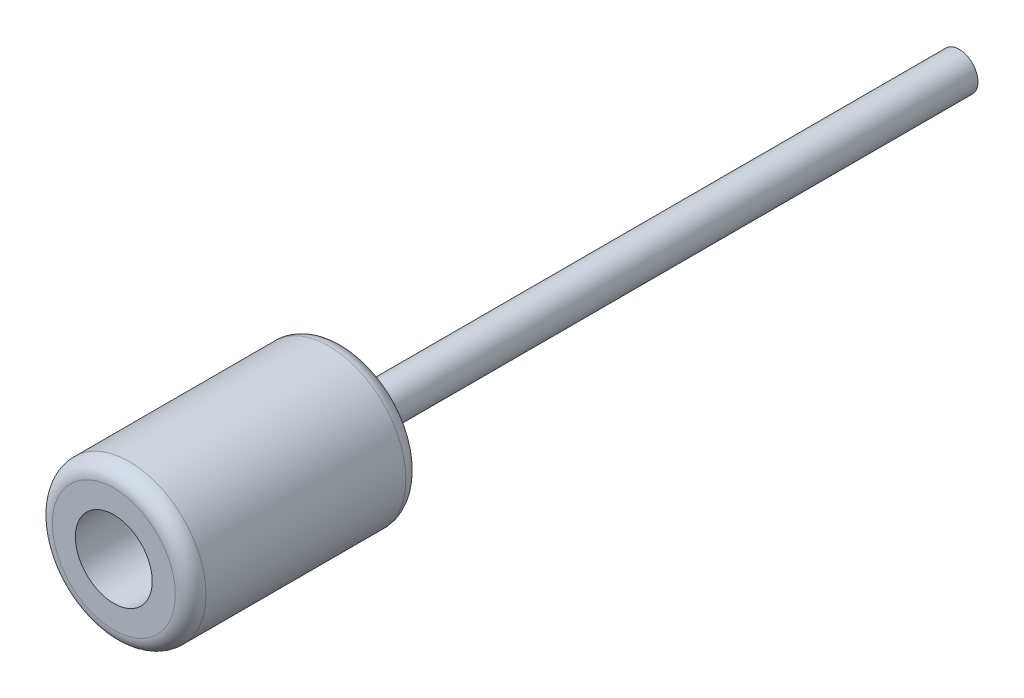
from build123d import *

# Parameters (mm, degrees)
SKETCH1_R           = 12.7
BOSS_EXTRUDE1_DEPTH = 38.1
SHELL1_T            = -6.35
FILLET1_R           = 2.54
FILLET2_R           = 2.54
SKETCH2_R           = 3.1115
BOSS_EXTRUDE2_DEPTH = 101.6


with BuildPart() as part:
    # Sketch1 → Boss-Extrude1 (new body)
    with BuildSketch(Plane.XY):
        with Locations(Location((0, 0, 0), (0, 0, 180))):
            Circle(SKETCH1_R)
    extrude(amount=BOSS_EXTRUDE1_DEPTH)

    # Shell1
    shell1_openings = [part.faces().sort_by_distance(p)[0] for p in [
        (0, 0, 38.1),
    ]]
    offset(amount=SHELL1_T, openings=shell1_openings, kind=Kind.INTERSECTION)

    # Fillet1
    fillet1_edges = [part.edges().sort_by_distance(p)[0] for p in [
        (12.7, 0, 0),
    ]]
    fillet(fillet1_edges, radius=FILLET1_R)

    # Fillet2
    fillet2_edges = [part.edges().sort_by_distance(p)[0] for p in [
        (12.7, 0, 38.1),
    ]]
    fillet(fillet2_edges, radius=FILLET2_R)

    # Sketch2 → Boss-Extrude2 (add)
    with BuildSketch(Plane(origin=(0, 0, 0), x_dir=(-1, 0, 0), z_dir=(0, 0, -1))):
        with Locations(Location((0, 0, 0), (0, 0, 180))):
            Circle(SKETCH2_R)
    extrude(amount=BOSS_EXTRUDE2_DEPTH)


solid = part.part
